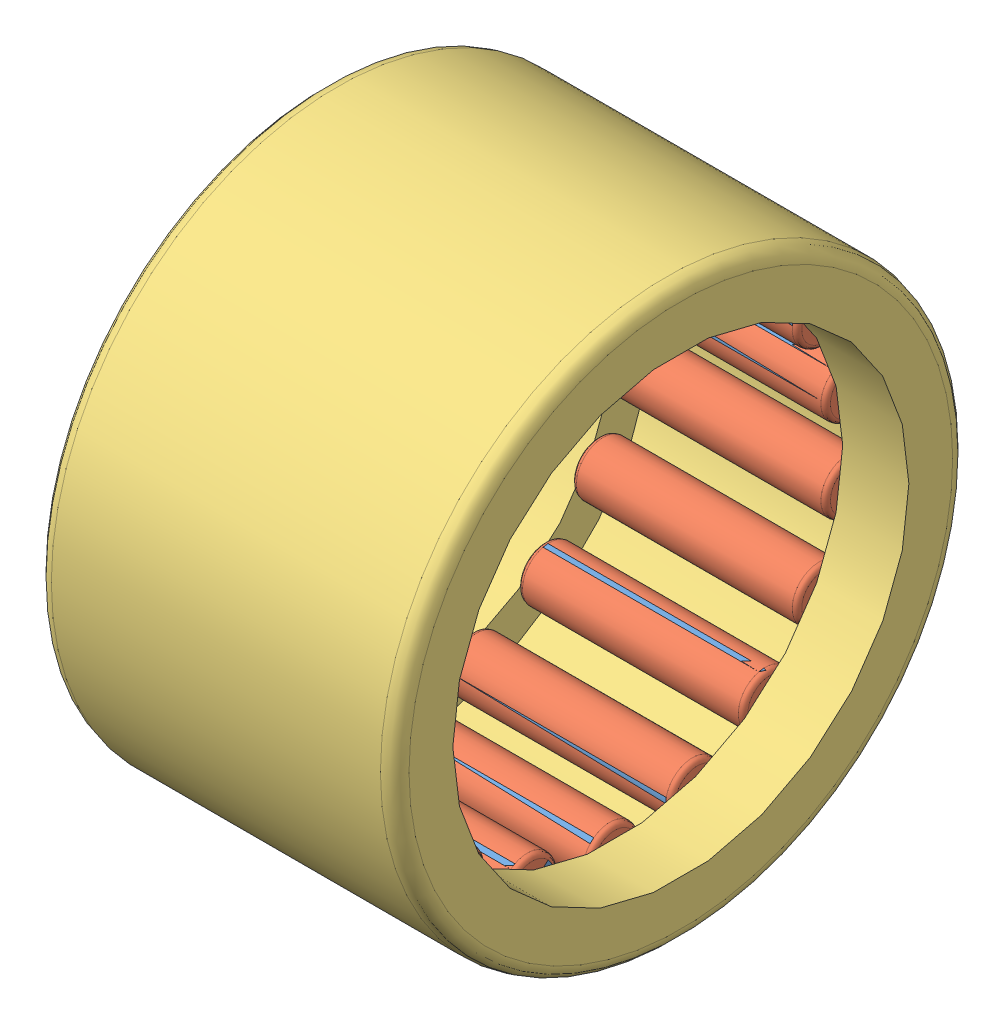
SolidWorks assembly 4639000047_HK_1210.sldasm, configuration Default (file format 13000). Lengths in mm.
Overall size (10 16 16).
37 component instances, 3 part files, 0 mates.
Components (placement in the parent):
- 4639000047_HK_1210_3-1: 4639000047_HK_1210_3.SLDPRT [Default] x (1 0 0) z (0 -0.34202 0.939693) size (6.3 1.5 1.5)
- 4639000047_HK_1210_3-2: 4639000047_HK_1210_3.SLDPRT [Default] x (1 0 0) z (0 -0.642788 0.766044) size (6.3 1.5 1.5)
- 4639000047_HK_1210_3-3: 4639000047_HK_1210_3.SLDPRT [Default] x (1 0 0) z (0 -0.866025 0.5) size (6.3 1.5 1.5)
- 4639000047_HK_1210_3-4: 4639000047_HK_1210_3.SLDPRT [Default] x (1 0 0) z (0 -0.984808 0.173648) size (6.3 1.5 1.5)
- 4639000047_HK_1210_3-5: 4639000047_HK_1210_3.SLDPRT [Default] x (1 0 0) z (0 -0.984808 -0.173648) size (6.3 1.5 1.5)
- 4639000047_HK_1210_3-6: 4639000047_HK_1210_3.SLDPRT [Default] x (1 0 0) z (0 -0.866025 -0.5) size (6.3 1.5 1.5)
- 4639000047_HK_1210_3-7: 4639000047_HK_1210_3.SLDPRT [Default] x (1 0 0) z (0 -0.642788 -0.766044) size (6.3 1.5 1.5)
- 4639000047_HK_1210_3-8: 4639000047_HK_1210_3.SLDPRT [Default] x (1 0 0) z (0 -0.34202 -0.939693) size (6.3 1.5 1.5)
- 4639000047_HK_1210_3-9: 4639000047_HK_1210_3.SLDPRT [Default] x (1 0 0) z (0 0 -1) size (6.3 1.5 1.5)
- 4639000047_HK_1210_3-10: 4639000047_HK_1210_3.SLDPRT [Default] x (1 0 0) z (0 0.34202 -0.939693) size (6.3 1.5 1.5)
- 4639000047_HK_1210_3-11: 4639000047_HK_1210_3.SLDPRT [Default] x (1 0 0) z (0 0.642788 -0.766044) size (6.3 1.5 1.5)
- 4639000047_HK_1210_3-12: 4639000047_HK_1210_3.SLDPRT [Default] x (1 0 0) z (0 0.866025 -0.5) size (6.3 1.5 1.5)
- 4639000047_HK_1210_3-13: 4639000047_HK_1210_3.SLDPRT [Default] x (1 0 0) z (0 0.984808 -0.173648) size (6.3 1.5 1.5)
- 4639000047_HK_1210_3-14: 4639000047_HK_1210_3.SLDPRT [Default] x (1 0 0) z (0 0.984808 0.173648) size (6.3 1.5 1.5)
- 4639000047_HK_1210_3-15: 4639000047_HK_1210_3.SLDPRT [Default] x (1 0 0) z (0 0.866025 0.5) size (6.3 1.5 1.5)
- 4639000047_HK_1210_3-16: 4639000047_HK_1210_3.SLDPRT [Default] x (1 0 0) z (0 0.642788 0.766044) size (6.3 1.5 1.5)
- 4639000047_HK_1210_3-17: 4639000047_HK_1210_3.SLDPRT [Default] x (1 0 0) z (0 0.34202 0.939693) size (6.3 1.5 1.5)
- 4639000047_HK_1210_3-18: 4639000047_HK_1210_3.SLDPRT [Default] at origin size (6.3 1.5 1.5)
- 4639000047_HK_1210_2-19: 4639000047_HK_1210_2.SLDPRT [Default] x (1 0 0) z (0 -0.34202 0.939693) size (6.3 1.5 1.5)
- 4639000047_HK_1210_2-20: 4639000047_HK_1210_2.SLDPRT [Default] x (1 0 0) z (0 -0.642788 0.766044) size (6.3 1.5 1.5)
- 4639000047_HK_1210_2-21: 4639000047_HK_1210_2.SLDPRT [Default] x (1 0 0) z (0 -0.866025 0.5) size (6.3 1.5 1.5)
- 4639000047_HK_1210_2-22: 4639000047_HK_1210_2.SLDPRT [Default] x (1 0 0) z (0 -0.984808 0.173648) size (6.3 1.5 1.5)
- 4639000047_HK_1210_2-23: 4639000047_HK_1210_2.SLDPRT [Default] x (1 0 0) z (0 -0.984808 -0.173648) size (6.3 1.5 1.5)
- 4639000047_HK_1210_2-24: 4639000047_HK_1210_2.SLDPRT [Default] x (1 0 0) z (0 -0.866025 -0.5) size (6.3 1.5 1.5)
- 4639000047_HK_1210_2-25: 4639000047_HK_1210_2.SLDPRT [Default] x (1 0 0) z (0 -0.642788 -0.766044) size (6.3 1.5 1.5)
- 4639000047_HK_1210_2-26: 4639000047_HK_1210_2.SLDPRT [Default] x (1 0 0) z (0 -0.34202 -0.939693) size (6.3 1.5 1.5)
- 4639000047_HK_1210_2-27: 4639000047_HK_1210_2.SLDPRT [Default] x (1 0 0) z (0 0 -1) size (6.3 1.5 1.5)
- 4639000047_HK_1210_2-28: 4639000047_HK_1210_2.SLDPRT [Default] x (1 0 0) z (0 0.34202 -0.939693) size (6.3 1.5 1.5)
- 4639000047_HK_1210_2-29: 4639000047_HK_1210_2.SLDPRT [Default] x (1 0 0) z (0 0.642788 -0.766044) size (6.3 1.5 1.5)
- 4639000047_HK_1210_2-30: 4639000047_HK_1210_2.SLDPRT [Default] x (1 0 0) z (0 0.866025 -0.5) size (6.3 1.5 1.5)
- 4639000047_HK_1210_2-31: 4639000047_HK_1210_2.SLDPRT [Default] x (1 0 0) z (0 0.984808 -0.173648) size (6.3 1.5 1.5)
- 4639000047_HK_1210_2-32: 4639000047_HK_1210_2.SLDPRT [Default] x (1 0 0) z (0 0.984808 0.173648) size (6.3 1.5 1.5)
- 4639000047_HK_1210_2-33: 4639000047_HK_1210_2.SLDPRT [Default] x (1 0 0) z (0 0.866025 0.5) size (6.3 1.5 1.5)
- 4639000047_HK_1210_2-34: 4639000047_HK_1210_2.SLDPRT [Default] x (1 0 0) z (0 0.642788 0.766044) size (6.3 1.5 1.5)
- 4639000047_HK_1210_2-35: 4639000047_HK_1210_2.SLDPRT [Default] x (1 0 0) z (0 0.34202 0.939693) size (6.3 1.5 1.5)
- 4639000047_HK_1210_2-36: 4639000047_HK_1210_2.SLDPRT [Default] at origin size (6.3 1.5 1.5)
- 4639000047_HK_1210_1-2: 4639000047_HK_1210_1.SLDPRT [Default] at origin size (10 16 16)
